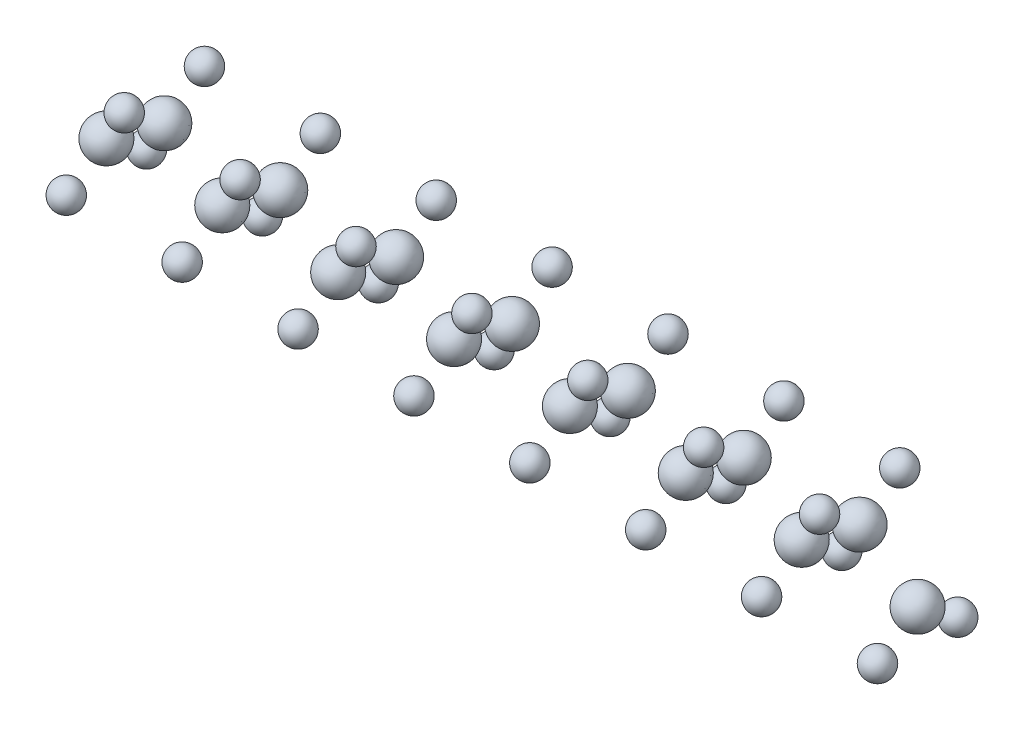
ISO-10303-21;
HEADER;
FILE_DESCRIPTION(('STEP AP214'),'2;1');
FILE_NAME('part.step','',(''),(''),'','','');
FILE_SCHEMA(('AUTOMOTIVE_DESIGN { 1 0 10303 214 1 1 1 1 }'));
ENDSEC;
DATA;
#1=APPLICATION_CONTEXT('core data for automotive mechanical design processes');
#2=APPLICATION_PROTOCOL_DEFINITION('international standard','automotive_design',2000,#1);
#3=PRODUCT_CONTEXT('',#1,'mechanical');
#4=PRODUCT('Part','Part','',(#3));
#5=PRODUCT_RELATED_PRODUCT_CATEGORY('part','',(#4));
#6=PRODUCT_DEFINITION_FORMATION('','',#4);
#7=PRODUCT_DEFINITION_CONTEXT('part definition',#1,'design');
#8=PRODUCT_DEFINITION('design','',#6,#7);
#9=PRODUCT_DEFINITION_SHAPE('','',#8);
#10=(LENGTH_UNIT() NAMED_UNIT(*) SI_UNIT(.MILLI.,.METRE.));
#11=(NAMED_UNIT(*) PLANE_ANGLE_UNIT() SI_UNIT($,.RADIAN.));
#12=(NAMED_UNIT(*) SI_UNIT($,.STERADIAN.) SOLID_ANGLE_UNIT());
#13=UNCERTAINTY_MEASURE_WITH_UNIT(LENGTH_MEASURE(1.E-05),#10,'distance_accuracy_value','');
#14=(GEOMETRIC_REPRESENTATION_CONTEXT(3) GLOBAL_UNCERTAINTY_ASSIGNED_CONTEXT((#13)) GLOBAL_UNIT_ASSIGNED_CONTEXT((#10,
#11,#12)) REPRESENTATION_CONTEXT('',''));
#15=CARTESIAN_POINT('',(0.,0.,0.));
#16=DIRECTION('',(0.,0.,1.));
#17=DIRECTION('',(1.,0.,0.));
#18=AXIS2_PLACEMENT_3D('',#15,#16,#17);
#19=CARTESIAN_POINT('',(16.406864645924,1.55175306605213,-0.873738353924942));
#20=DIRECTION('',(0.,1.,0.));
#21=DIRECTION('',(0.,0.,-1.));
#22=AXIS2_PLACEMENT_3D('',#19,#20,#21);
#23=SPHERICAL_SURFACE('',#22,0.3125);
#24=CARTESIAN_POINT('',(16.406864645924,1.86425306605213,-0.873738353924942));
#25=VERTEX_POINT('',#24);
#26=VERTEX_LOOP('',#25);
#27=FACE_BOUND('',#26,.T.);
#28=ADVANCED_FACE('F34',(#27),#23,.T.);
#29=CLOSED_SHELL('',(#28));
#30=MANIFOLD_SOLID_BREP('B2',#29);
#31=CARTESIAN_POINT('',(13.8827316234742,1.55175306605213,-0.873738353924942));
#32=DIRECTION('',(0.,1.,0.));
#33=DIRECTION('',(0.,0.,-1.));
#34=AXIS2_PLACEMENT_3D('',#31,#32,#33);
#35=SPHERICAL_SURFACE('',#34,0.3125);
#36=CARTESIAN_POINT('',(13.8827316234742,1.86425306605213,-0.873738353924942));
#37=VERTEX_POINT('',#36);
#38=VERTEX_LOOP('',#37);
#39=FACE_BOUND('',#38,.T.);
#40=ADVANCED_FACE('F53',(#39),#35,.T.);
#41=CLOSED_SHELL('',(#40));
#42=MANIFOLD_SOLID_BREP('B6',#41);
#43=CARTESIAN_POINT('',(11.3585986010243,1.55175306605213,-0.873738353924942));
#44=DIRECTION('',(0.,1.,0.));
#45=DIRECTION('',(0.,0.,-1.));
#46=AXIS2_PLACEMENT_3D('',#43,#44,#45);
#47=SPHERICAL_SURFACE('',#46,0.3125);
#48=CARTESIAN_POINT('',(11.3585986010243,1.86425306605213,-0.873738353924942));
#49=VERTEX_POINT('',#48);
#50=VERTEX_LOOP('',#49);
#51=FACE_BOUND('',#50,.T.);
#52=ADVANCED_FACE('F72',(#51),#47,.T.);
#53=CLOSED_SHELL('',(#52));
#54=MANIFOLD_SOLID_BREP('B30',#53);
#55=CARTESIAN_POINT('',(8.83446557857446,1.55175306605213,-0.873738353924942));
#56=DIRECTION('',(0.,1.,0.));
#57=DIRECTION('',(0.,0.,-1.));
#58=AXIS2_PLACEMENT_3D('',#55,#56,#57);
#59=SPHERICAL_SURFACE('',#58,0.3125);
#60=CARTESIAN_POINT('',(8.83446557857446,1.86425306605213,-0.873738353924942));
#61=VERTEX_POINT('',#60);
#62=VERTEX_LOOP('',#61);
#63=FACE_BOUND('',#62,.T.);
#64=ADVANCED_FACE('F91',(#63),#59,.T.);
#65=CLOSED_SHELL('',(#64));
#66=MANIFOLD_SOLID_BREP('B49',#65);
#67=CARTESIAN_POINT('',(6.31033255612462,1.55175306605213,-0.873738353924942));
#68=DIRECTION('',(0.,1.,0.));
#69=DIRECTION('',(0.,0.,-1.));
#70=AXIS2_PLACEMENT_3D('',#67,#68,#69);
#71=SPHERICAL_SURFACE('',#70,0.3125);
#72=CARTESIAN_POINT('',(6.31033255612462,1.86425306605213,-0.873738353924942));
#73=VERTEX_POINT('',#72);
#74=VERTEX_LOOP('',#73);
#75=FACE_BOUND('',#74,.T.);
#76=ADVANCED_FACE('F110',(#75),#71,.T.);
#77=CLOSED_SHELL('',(#76));
#78=MANIFOLD_SOLID_BREP('B68',#77);
#79=CARTESIAN_POINT('',(3.78619953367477,1.55175306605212,-0.873738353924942));
#80=DIRECTION('',(0.,1.,0.));
#81=DIRECTION('',(0.,0.,-1.));
#82=AXIS2_PLACEMENT_3D('',#79,#80,#81);
#83=SPHERICAL_SURFACE('',#82,0.3125);
#84=CARTESIAN_POINT('',(3.78619953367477,1.86425306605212,-0.873738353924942));
#85=VERTEX_POINT('',#84);
#86=VERTEX_LOOP('',#85);
#87=FACE_BOUND('',#86,.T.);
#88=ADVANCED_FACE('F129',(#87),#83,.T.);
#89=CLOSED_SHELL('',(#88));
#90=MANIFOLD_SOLID_BREP('B87',#89);
#91=CARTESIAN_POINT('',(16.406864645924,1.55175306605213,0.873738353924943));
#92=DIRECTION('',(0.,1.,0.));
#93=DIRECTION('',(0.,0.,-1.));
#94=AXIS2_PLACEMENT_3D('',#91,#92,#93);
#95=SPHERICAL_SURFACE('',#94,0.3125);
#96=CARTESIAN_POINT('',(16.406864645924,1.86425306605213,0.873738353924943));
#97=VERTEX_POINT('',#96);
#98=VERTEX_LOOP('',#97);
#99=FACE_BOUND('',#98,.T.);
#100=ADVANCED_FACE('F148',(#99),#95,.T.);
#101=CLOSED_SHELL('',(#100));
#102=MANIFOLD_SOLID_BREP('B106',#101);
#103=CARTESIAN_POINT('',(13.8827316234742,1.55175306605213,0.873738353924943));
#104=DIRECTION('',(0.,1.,0.));
#105=DIRECTION('',(0.,0.,-1.));
#106=AXIS2_PLACEMENT_3D('',#103,#104,#105);
#107=SPHERICAL_SURFACE('',#106,0.3125);
#108=CARTESIAN_POINT('',(13.8827316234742,1.86425306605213,0.873738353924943));
#109=VERTEX_POINT('',#108);
#110=VERTEX_LOOP('',#109);
#111=FACE_BOUND('',#110,.T.);
#112=ADVANCED_FACE('F167',(#111),#107,.T.);
#113=CLOSED_SHELL('',(#112));
#114=MANIFOLD_SOLID_BREP('B125',#113);
#115=CARTESIAN_POINT('',(11.3585986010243,1.55175306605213,0.873738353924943));
#116=DIRECTION('',(0.,1.,0.));
#117=DIRECTION('',(0.,0.,-1.));
#118=AXIS2_PLACEMENT_3D('',#115,#116,#117);
#119=SPHERICAL_SURFACE('',#118,0.3125);
#120=CARTESIAN_POINT('',(11.3585986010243,1.86425306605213,0.873738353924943));
#121=VERTEX_POINT('',#120);
#122=VERTEX_LOOP('',#121);
#123=FACE_BOUND('',#122,.T.);
#124=ADVANCED_FACE('F186',(#123),#119,.T.);
#125=CLOSED_SHELL('',(#124));
#126=MANIFOLD_SOLID_BREP('B144',#125);
#127=CARTESIAN_POINT('',(8.83446557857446,1.55175306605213,0.873738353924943));
#128=DIRECTION('',(0.,1.,0.));
#129=DIRECTION('',(0.,0.,-1.));
#130=AXIS2_PLACEMENT_3D('',#127,#128,#129);
#131=SPHERICAL_SURFACE('',#130,0.3125);
#132=CARTESIAN_POINT('',(8.83446557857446,1.86425306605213,0.873738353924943));
#133=VERTEX_POINT('',#132);
#134=VERTEX_LOOP('',#133);
#135=FACE_BOUND('',#134,.T.);
#136=ADVANCED_FACE('F205',(#135),#131,.T.);
#137=CLOSED_SHELL('',(#136));
#138=MANIFOLD_SOLID_BREP('B163',#137);
#139=CARTESIAN_POINT('',(6.31033255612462,1.55175306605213,0.873738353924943));
#140=DIRECTION('',(0.,1.,0.));
#141=DIRECTION('',(0.,0.,-1.));
#142=AXIS2_PLACEMENT_3D('',#139,#140,#141);
#143=SPHERICAL_SURFACE('',#142,0.3125);
#144=CARTESIAN_POINT('',(6.31033255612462,1.86425306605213,0.873738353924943));
#145=VERTEX_POINT('',#144);
#146=VERTEX_LOOP('',#145);
#147=FACE_BOUND('',#146,.T.);
#148=ADVANCED_FACE('F224',(#147),#143,.T.);
#149=CLOSED_SHELL('',(#148));
#150=MANIFOLD_SOLID_BREP('B182',#149);
#151=CARTESIAN_POINT('',(3.78619953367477,1.55175306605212,0.873738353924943));
#152=DIRECTION('',(0.,1.,0.));
#153=DIRECTION('',(0.,0.,-1.));
#154=AXIS2_PLACEMENT_3D('',#151,#152,#153);
#155=SPHERICAL_SURFACE('',#154,0.3125);
#156=CARTESIAN_POINT('',(3.78619953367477,1.86425306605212,0.873738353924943));
#157=VERTEX_POINT('',#156);
#158=VERTEX_LOOP('',#157);
#159=FACE_BOUND('',#158,.T.);
#160=ADVANCED_FACE('F243',(#159),#155,.T.);
#161=CLOSED_SHELL('',(#160));
#162=MANIFOLD_SOLID_BREP('B201',#161);
#163=CARTESIAN_POINT('',(17.6689311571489,-0.634808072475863,-0.873738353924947));
#164=DIRECTION('',(0.,1.,0.));
#165=DIRECTION('',(0.,0.,-1.));
#166=AXIS2_PLACEMENT_3D('',#163,#164,#165);
#167=SPHERICAL_SURFACE('',#166,0.3125);
#168=CARTESIAN_POINT('',(17.6689311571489,-0.322308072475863,-0.873738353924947));
#169=VERTEX_POINT('',#168);
#170=VERTEX_LOOP('',#169);
#171=FACE_BOUND('',#170,.T.);
#172=ADVANCED_FACE('F262',(#171),#167,.T.);
#173=CLOSED_SHELL('',(#172));
#174=MANIFOLD_SOLID_BREP('B220',#173);
#175=CARTESIAN_POINT('',(15.1447981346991,-0.634808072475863,-0.873738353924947));
#176=DIRECTION('',(0.,1.,0.));
#177=DIRECTION('',(0.,0.,-1.));
#178=AXIS2_PLACEMENT_3D('',#175,#176,#177);
#179=SPHERICAL_SURFACE('',#178,0.3125);
#180=CARTESIAN_POINT('',(15.1447981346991,-0.322308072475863,-0.873738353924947));
#181=VERTEX_POINT('',#180);
#182=VERTEX_LOOP('',#181);
#183=FACE_BOUND('',#182,.T.);
#184=ADVANCED_FACE('F281',(#183),#179,.T.);
#185=CLOSED_SHELL('',(#184));
#186=MANIFOLD_SOLID_BREP('B239',#185);
#187=CARTESIAN_POINT('',(12.6206651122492,-0.634808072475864,-0.873738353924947));
#188=DIRECTION('',(0.,1.,0.));
#189=DIRECTION('',(0.,0.,-1.));
#190=AXIS2_PLACEMENT_3D('',#187,#188,#189);
#191=SPHERICAL_SURFACE('',#190,0.3125);
#192=CARTESIAN_POINT('',(12.6206651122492,-0.322308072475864,-0.873738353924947));
#193=VERTEX_POINT('',#192);
#194=VERTEX_LOOP('',#193);
#195=FACE_BOUND('',#194,.T.);
#196=ADVANCED_FACE('F300',(#195),#191,.T.);
#197=CLOSED_SHELL('',(#196));
#198=MANIFOLD_SOLID_BREP('B258',#197);
#199=CARTESIAN_POINT('',(10.0965320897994,-0.634808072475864,-0.873738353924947));
#200=DIRECTION('',(0.,1.,0.));
#201=DIRECTION('',(0.,0.,-1.));
#202=AXIS2_PLACEMENT_3D('',#199,#200,#201);
#203=SPHERICAL_SURFACE('',#202,0.3125);
#204=CARTESIAN_POINT('',(10.0965320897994,-0.322308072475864,-0.873738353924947));
#205=VERTEX_POINT('',#204);
#206=VERTEX_LOOP('',#205);
#207=FACE_BOUND('',#206,.T.);
#208=ADVANCED_FACE('F319',(#207),#203,.T.);
#209=CLOSED_SHELL('',(#208));
#210=MANIFOLD_SOLID_BREP('B277',#209);
#211=CARTESIAN_POINT('',(7.57239906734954,-0.634808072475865,-0.873738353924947));
#212=DIRECTION('',(0.,1.,0.));
#213=DIRECTION('',(0.,0.,-1.));
#214=AXIS2_PLACEMENT_3D('',#211,#212,#213);
#215=SPHERICAL_SURFACE('',#214,0.3125);
#216=CARTESIAN_POINT('',(7.57239906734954,-0.322308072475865,-0.873738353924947));
#217=VERTEX_POINT('',#216);
#218=VERTEX_LOOP('',#217);
#219=FACE_BOUND('',#218,.T.);
#220=ADVANCED_FACE('F338',(#219),#215,.T.);
#221=CLOSED_SHELL('',(#220));
#222=MANIFOLD_SOLID_BREP('B296',#221);
#223=CARTESIAN_POINT('',(5.04826604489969,-0.634808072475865,-0.873738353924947));
#224=DIRECTION('',(0.,1.,0.));
#225=DIRECTION('',(0.,0.,-1.));
#226=AXIS2_PLACEMENT_3D('',#223,#224,#225);
#227=SPHERICAL_SURFACE('',#226,0.3125);
#228=CARTESIAN_POINT('',(5.04826604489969,-0.322308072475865,-0.873738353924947));
#229=VERTEX_POINT('',#228);
#230=VERTEX_LOOP('',#229);
#231=FACE_BOUND('',#230,.T.);
#232=ADVANCED_FACE('F357',(#231),#227,.T.);
#233=CLOSED_SHELL('',(#232));
#234=MANIFOLD_SOLID_BREP('B315',#233);
#235=CARTESIAN_POINT('',(2.52413302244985,-0.634808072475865,-0.873738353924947));
#236=DIRECTION('',(0.,1.,0.));
#237=DIRECTION('',(0.,0.,-1.));
#238=AXIS2_PLACEMENT_3D('',#235,#236,#237);
#239=SPHERICAL_SURFACE('',#238,0.3125);
#240=CARTESIAN_POINT('',(2.52413302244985,-0.322308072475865,-0.873738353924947));
#241=VERTEX_POINT('',#240);
#242=VERTEX_LOOP('',#241);
#243=FACE_BOUND('',#242,.T.);
#244=ADVANCED_FACE('F376',(#243),#239,.T.);
#245=CLOSED_SHELL('',(#244));
#246=MANIFOLD_SOLID_BREP('B334',#245);
#247=CARTESIAN_POINT('',(17.6689311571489,-0.63480807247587,0.873738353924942));
#248=DIRECTION('',(0.,1.,0.));
#249=DIRECTION('',(0.,0.,-1.));
#250=AXIS2_PLACEMENT_3D('',#247,#248,#249);
#251=SPHERICAL_SURFACE('',#250,0.3125);
#252=CARTESIAN_POINT('',(17.6689311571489,-0.32230807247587,0.873738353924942));
#253=VERTEX_POINT('',#252);
#254=VERTEX_LOOP('',#253);
#255=FACE_BOUND('',#254,.T.);
#256=ADVANCED_FACE('F395',(#255),#251,.T.);
#257=CLOSED_SHELL('',(#256));
#258=MANIFOLD_SOLID_BREP('B353',#257);
#259=CARTESIAN_POINT('',(15.1447981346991,-0.63480807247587,0.873738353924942));
#260=DIRECTION('',(0.,1.,0.));
#261=DIRECTION('',(0.,0.,-1.));
#262=AXIS2_PLACEMENT_3D('',#259,#260,#261);
#263=SPHERICAL_SURFACE('',#262,0.3125);
#264=CARTESIAN_POINT('',(15.1447981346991,-0.32230807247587,0.873738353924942));
#265=VERTEX_POINT('',#264);
#266=VERTEX_LOOP('',#265);
#267=FACE_BOUND('',#266,.T.);
#268=ADVANCED_FACE('F414',(#267),#263,.T.);
#269=CLOSED_SHELL('',(#268));
#270=MANIFOLD_SOLID_BREP('B372',#269);
#271=CARTESIAN_POINT('',(12.6206651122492,-0.634808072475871,0.873738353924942));
#272=DIRECTION('',(0.,1.,0.));
#273=DIRECTION('',(0.,0.,-1.));
#274=AXIS2_PLACEMENT_3D('',#271,#272,#273);
#275=SPHERICAL_SURFACE('',#274,0.3125);
#276=CARTESIAN_POINT('',(12.6206651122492,-0.322308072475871,0.873738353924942));
#277=VERTEX_POINT('',#276);
#278=VERTEX_LOOP('',#277);
#279=FACE_BOUND('',#278,.T.);
#280=ADVANCED_FACE('F433',(#279),#275,.T.);
#281=CLOSED_SHELL('',(#280));
#282=MANIFOLD_SOLID_BREP('B391',#281);
#283=CARTESIAN_POINT('',(10.0965320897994,-0.634808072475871,0.873738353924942));
#284=DIRECTION('',(0.,1.,0.));
#285=DIRECTION('',(0.,0.,-1.));
#286=AXIS2_PLACEMENT_3D('',#283,#284,#285);
#287=SPHERICAL_SURFACE('',#286,0.3125);
#288=CARTESIAN_POINT('',(10.0965320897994,-0.322308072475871,0.873738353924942));
#289=VERTEX_POINT('',#288);
#290=VERTEX_LOOP('',#289);
#291=FACE_BOUND('',#290,.T.);
#292=ADVANCED_FACE('F452',(#291),#287,.T.);
#293=CLOSED_SHELL('',(#292));
#294=MANIFOLD_SOLID_BREP('B410',#293);
#295=CARTESIAN_POINT('',(7.57239906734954,-0.634808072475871,0.873738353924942));
#296=DIRECTION('',(0.,1.,0.));
#297=DIRECTION('',(0.,0.,-1.));
#298=AXIS2_PLACEMENT_3D('',#295,#296,#297);
#299=SPHERICAL_SURFACE('',#298,0.3125);
#300=CARTESIAN_POINT('',(7.57239906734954,-0.322308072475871,0.873738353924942));
#301=VERTEX_POINT('',#300);
#302=VERTEX_LOOP('',#301);
#303=FACE_BOUND('',#302,.T.);
#304=ADVANCED_FACE('F471',(#303),#299,.T.);
#305=CLOSED_SHELL('',(#304));
#306=MANIFOLD_SOLID_BREP('B429',#305);
#307=CARTESIAN_POINT('',(5.04826604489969,-0.634808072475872,0.873738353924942));
#308=DIRECTION('',(0.,1.,0.));
#309=DIRECTION('',(0.,0.,-1.));
#310=AXIS2_PLACEMENT_3D('',#307,#308,#309);
#311=SPHERICAL_SURFACE('',#310,0.3125);
#312=CARTESIAN_POINT('',(5.04826604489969,-0.322308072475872,0.873738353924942));
#313=VERTEX_POINT('',#312);
#314=VERTEX_LOOP('',#313);
#315=FACE_BOUND('',#314,.T.);
#316=ADVANCED_FACE('F490',(#315),#311,.T.);
#317=CLOSED_SHELL('',(#316));
#318=MANIFOLD_SOLID_BREP('B448',#317);
#319=CARTESIAN_POINT('',(2.52413302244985,-0.634808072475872,0.873738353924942));
#320=DIRECTION('',(0.,1.,0.));
#321=DIRECTION('',(0.,0.,-1.));
#322=AXIS2_PLACEMENT_3D('',#319,#320,#321);
#323=SPHERICAL_SURFACE('',#322,0.3125);
#324=CARTESIAN_POINT('',(2.52413302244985,-0.322308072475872,0.873738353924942));
#325=VERTEX_POINT('',#324);
#326=VERTEX_LOOP('',#325);
#327=FACE_BOUND('',#326,.T.);
#328=ADVANCED_FACE('F509',(#327),#323,.T.);
#329=CLOSED_SHELL('',(#328));
#330=MANIFOLD_SOLID_BREP('B467',#329);
#331=CARTESIAN_POINT('',(17.6681330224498,0.,0.));
#332=DIRECTION('',(0.,1.,0.));
#333=DIRECTION('',(1.,0.,0.));
#334=AXIS2_PLACEMENT_3D('',#331,#332,#333);
#335=SPHERICAL_SURFACE('',#334,0.425);
#336=CARTESIAN_POINT('',(17.6681330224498,0.425000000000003,0.));
#337=VERTEX_POINT('',#336);
#338=VERTEX_LOOP('',#337);
#339=FACE_BOUND('',#338,.T.);
#340=ADVANCED_FACE('F528',(#339),#335,.T.);
#341=CLOSED_SHELL('',(#340));
#342=MANIFOLD_SOLID_BREP('B486',#341);
#343=CARTESIAN_POINT('',(1.26206651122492,1.55175306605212,-0.873738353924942));
#344=DIRECTION('',(0.,1.,0.));
#345=DIRECTION('',(0.,0.,-1.));
#346=AXIS2_PLACEMENT_3D('',#343,#344,#345);
#347=SPHERICAL_SURFACE('',#346,0.3125);
#348=CARTESIAN_POINT('',(1.26206651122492,1.86425306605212,-0.873738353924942));
#349=VERTEX_POINT('',#348);
#350=VERTEX_LOOP('',#349);
#351=FACE_BOUND('',#350,.T.);
#352=ADVANCED_FACE('F547',(#351),#347,.T.);
#353=CLOSED_SHELL('',(#352));
#354=MANIFOLD_SOLID_BREP('B505',#353);
#355=CARTESIAN_POINT('',(1.26206651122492,1.55175306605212,0.873738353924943));
#356=DIRECTION('',(0.,1.,0.));
#357=DIRECTION('',(0.,0.,-1.));
#358=AXIS2_PLACEMENT_3D('',#355,#356,#357);
#359=SPHERICAL_SURFACE('',#358,0.3125);
#360=CARTESIAN_POINT('',(1.26206651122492,1.86425306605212,0.873738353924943));
#361=VERTEX_POINT('',#360);
#362=VERTEX_LOOP('',#361);
#363=FACE_BOUND('',#362,.T.);
#364=ADVANCED_FACE('F566',(#363),#359,.T.);
#365=CLOSED_SHELL('',(#364));
#366=MANIFOLD_SOLID_BREP('B524',#365);
#367=CARTESIAN_POINT('',(0.,-0.634808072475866,-0.873738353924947));
#368=DIRECTION('',(0.,1.,0.));
#369=DIRECTION('',(0.,0.,-1.));
#370=AXIS2_PLACEMENT_3D('',#367,#368,#369);
#371=SPHERICAL_SURFACE('',#370,0.3125);
#372=CARTESIAN_POINT('',(0.,-0.322308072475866,-0.873738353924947));
#373=VERTEX_POINT('',#372);
#374=VERTEX_LOOP('',#373);
#375=FACE_BOUND('',#374,.T.);
#376=ADVANCED_FACE('F585',(#375),#371,.T.);
#377=CLOSED_SHELL('',(#376));
#378=MANIFOLD_SOLID_BREP('B543',#377);
#379=CARTESIAN_POINT('',(0.,-0.634808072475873,0.873738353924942));
#380=DIRECTION('',(0.,1.,0.));
#381=DIRECTION('',(0.,0.,-1.));
#382=AXIS2_PLACEMENT_3D('',#379,#380,#381);
#383=SPHERICAL_SURFACE('',#382,0.3125);
#384=CARTESIAN_POINT('',(0.,-0.322308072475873,0.873738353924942));
#385=VERTEX_POINT('',#384);
#386=VERTEX_LOOP('',#385);
#387=FACE_BOUND('',#386,.T.);
#388=ADVANCED_FACE('F604',(#387),#383,.T.);
#389=CLOSED_SHELL('',(#388));
#390=MANIFOLD_SOLID_BREP('B562',#389);
#391=CARTESIAN_POINT('',(15.144,0.,0.));
#392=DIRECTION('',(0.,1.,0.));
#393=DIRECTION('',(1.,0.,0.));
#394=AXIS2_PLACEMENT_3D('',#391,#392,#393);
#395=SPHERICAL_SURFACE('',#394,0.425);
#396=CARTESIAN_POINT('',(15.144,0.425000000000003,0.));
#397=VERTEX_POINT('',#396);
#398=VERTEX_LOOP('',#397);
#399=FACE_BOUND('',#398,.T.);
#400=ADVANCED_FACE('F623',(#399),#395,.T.);
#401=CLOSED_SHELL('',(#400));
#402=MANIFOLD_SOLID_BREP('B581',#401);
#403=CARTESIAN_POINT('',(12.62,0.,0.));
#404=DIRECTION('',(0.,1.,0.));
#405=DIRECTION('',(1.,0.,0.));
#406=AXIS2_PLACEMENT_3D('',#403,#404,#405);
#407=SPHERICAL_SURFACE('',#406,0.425);
#408=CARTESIAN_POINT('',(12.62,0.425000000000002,0.));
#409=VERTEX_POINT('',#408);
#410=VERTEX_LOOP('',#409);
#411=FACE_BOUND('',#410,.T.);
#412=ADVANCED_FACE('F642',(#411),#407,.T.);
#413=CLOSED_SHELL('',(#412));
#414=MANIFOLD_SOLID_BREP('B600',#413);
#415=CARTESIAN_POINT('',(10.096,0.,0.));
#416=DIRECTION('',(0.,1.,0.));
#417=DIRECTION('',(1.,0.,0.));
#418=AXIS2_PLACEMENT_3D('',#415,#416,#417);
#419=SPHERICAL_SURFACE('',#418,0.425);
#420=CARTESIAN_POINT('',(10.096,0.425000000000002,0.));
#421=VERTEX_POINT('',#420);
#422=VERTEX_LOOP('',#421);
#423=FACE_BOUND('',#422,.T.);
#424=ADVANCED_FACE('F661',(#423),#419,.T.);
#425=CLOSED_SHELL('',(#424));
#426=MANIFOLD_SOLID_BREP('B619',#425);
#427=CARTESIAN_POINT('',(7.572,0.,0.));
#428=DIRECTION('',(0.,1.,0.));
#429=DIRECTION('',(1.,0.,0.));
#430=AXIS2_PLACEMENT_3D('',#427,#428,#429);
#431=SPHERICAL_SURFACE('',#430,0.425);
#432=CARTESIAN_POINT('',(7.572,0.425000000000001,0.));
#433=VERTEX_POINT('',#432);
#434=VERTEX_LOOP('',#433);
#435=FACE_BOUND('',#434,.T.);
#436=ADVANCED_FACE('F680',(#435),#431,.T.);
#437=CLOSED_SHELL('',(#436));
#438=MANIFOLD_SOLID_BREP('B638',#437);
#439=CARTESIAN_POINT('',(5.048,0.,0.));
#440=DIRECTION('',(0.,1.,0.));
#441=DIRECTION('',(1.,0.,0.));
#442=AXIS2_PLACEMENT_3D('',#439,#440,#441);
#443=SPHERICAL_SURFACE('',#442,0.425);
#444=CARTESIAN_POINT('',(5.048,0.425000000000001,0.));
#445=VERTEX_POINT('',#444);
#446=VERTEX_LOOP('',#445);
#447=FACE_BOUND('',#446,.T.);
#448=ADVANCED_FACE('F699',(#447),#443,.T.);
#449=CLOSED_SHELL('',(#448));
#450=MANIFOLD_SOLID_BREP('B657',#449);
#451=CARTESIAN_POINT('',(2.524,0.,0.));
#452=DIRECTION('',(0.,1.,0.));
#453=DIRECTION('',(1.,0.,0.));
#454=AXIS2_PLACEMENT_3D('',#451,#452,#453);
#455=SPHERICAL_SURFACE('',#454,0.425);
#456=CARTESIAN_POINT('',(2.524,0.425,0.));
#457=VERTEX_POINT('',#456);
#458=VERTEX_LOOP('',#457);
#459=FACE_BOUND('',#458,.T.);
#460=ADVANCED_FACE('F718',(#459),#455,.T.);
#461=CLOSED_SHELL('',(#460));
#462=MANIFOLD_SOLID_BREP('B676',#461);
#463=CARTESIAN_POINT('',(16.4060665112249,0.916944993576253,0.));
#464=DIRECTION('',(0.,1.,0.));
#465=DIRECTION('',(1.,0.,0.));
#466=AXIS2_PLACEMENT_3D('',#463,#464,#465);
#467=SPHERICAL_SURFACE('',#466,0.425);
#468=CARTESIAN_POINT('',(16.4060665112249,1.34194499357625,0.));
#469=VERTEX_POINT('',#468);
#470=VERTEX_LOOP('',#469);
#471=FACE_BOUND('',#470,.T.);
#472=ADVANCED_FACE('F737',(#471),#467,.T.);
#473=CLOSED_SHELL('',(#472));
#474=MANIFOLD_SOLID_BREP('B695',#473);
#475=CARTESIAN_POINT('',(13.8820665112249,0.916944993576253,0.));
#476=DIRECTION('',(0.,1.,0.));
#477=DIRECTION('',(1.,0.,0.));
#478=AXIS2_PLACEMENT_3D('',#475,#476,#477);
#479=SPHERICAL_SURFACE('',#478,0.425);
#480=CARTESIAN_POINT('',(13.8820665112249,1.34194499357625,0.));
#481=VERTEX_POINT('',#480);
#482=VERTEX_LOOP('',#481);
#483=FACE_BOUND('',#482,.T.);
#484=ADVANCED_FACE('F756',(#483),#479,.T.);
#485=CLOSED_SHELL('',(#484));
#486=MANIFOLD_SOLID_BREP('B714',#485);
#487=CARTESIAN_POINT('',(11.3580665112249,0.916944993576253,0.));
#488=DIRECTION('',(0.,1.,0.));
#489=DIRECTION('',(1.,0.,0.));
#490=AXIS2_PLACEMENT_3D('',#487,#488,#489);
#491=SPHERICAL_SURFACE('',#490,0.425);
#492=CARTESIAN_POINT('',(11.3580665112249,1.34194499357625,0.));
#493=VERTEX_POINT('',#492);
#494=VERTEX_LOOP('',#493);
#495=FACE_BOUND('',#494,.T.);
#496=ADVANCED_FACE('F775',(#495),#491,.T.);
#497=CLOSED_SHELL('',(#496));
#498=MANIFOLD_SOLID_BREP('B733',#497);
#499=CARTESIAN_POINT('',(8.83406651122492,0.916944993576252,0.));
#500=DIRECTION('',(0.,1.,0.));
#501=DIRECTION('',(1.,0.,0.));
#502=AXIS2_PLACEMENT_3D('',#499,#500,#501);
#503=SPHERICAL_SURFACE('',#502,0.425);
#504=CARTESIAN_POINT('',(8.83406651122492,1.34194499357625,0.));
#505=VERTEX_POINT('',#504);
#506=VERTEX_LOOP('',#505);
#507=FACE_BOUND('',#506,.T.);
#508=ADVANCED_FACE('F794',(#507),#503,.T.);
#509=CLOSED_SHELL('',(#508));
#510=MANIFOLD_SOLID_BREP('B752',#509);
#511=CARTESIAN_POINT('',(6.31006651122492,0.916944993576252,0.));
#512=DIRECTION('',(0.,1.,0.));
#513=DIRECTION('',(1.,0.,0.));
#514=AXIS2_PLACEMENT_3D('',#511,#512,#513);
#515=SPHERICAL_SURFACE('',#514,0.425);
#516=CARTESIAN_POINT('',(6.31006651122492,1.34194499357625,0.));
#517=VERTEX_POINT('',#516);
#518=VERTEX_LOOP('',#517);
#519=FACE_BOUND('',#518,.T.);
#520=ADVANCED_FACE('F813',(#519),#515,.T.);
#521=CLOSED_SHELL('',(#520));
#522=MANIFOLD_SOLID_BREP('B771',#521);
#523=CARTESIAN_POINT('',(3.78606651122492,0.916944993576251,0.));
#524=DIRECTION('',(0.,1.,0.));
#525=DIRECTION('',(1.,0.,0.));
#526=AXIS2_PLACEMENT_3D('',#523,#524,#525);
#527=SPHERICAL_SURFACE('',#526,0.425);
#528=CARTESIAN_POINT('',(3.78606651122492,1.34194499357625,0.));
#529=VERTEX_POINT('',#528);
#530=VERTEX_LOOP('',#529);
#531=FACE_BOUND('',#530,.T.);
#532=ADVANCED_FACE('F832',(#531),#527,.T.);
#533=CLOSED_SHELL('',(#532));
#534=MANIFOLD_SOLID_BREP('B790',#533);
#535=CARTESIAN_POINT('',(1.26206651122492,0.916944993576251,0.));
#536=DIRECTION('',(0.,1.,0.));
#537=DIRECTION('',(1.,0.,0.));
#538=AXIS2_PLACEMENT_3D('',#535,#536,#537);
#539=SPHERICAL_SURFACE('',#538,0.425);
#540=CARTESIAN_POINT('',(1.26206651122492,1.34194499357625,0.));
#541=VERTEX_POINT('',#540);
#542=VERTEX_LOOP('',#541);
#543=FACE_BOUND('',#542,.T.);
#544=ADVANCED_FACE('F850',(#543),#539,.T.);
#545=CLOSED_SHELL('',(#544));
#546=MANIFOLD_SOLID_BREP('B809',#545);
#547=CARTESIAN_POINT('',(0.,0.,0.));
#548=DIRECTION('',(0.,1.,0.));
#549=DIRECTION('',(1.,0.,0.));
#550=AXIS2_PLACEMENT_3D('',#547,#548,#549);
#551=SPHERICAL_SURFACE('',#550,0.425);
#552=CARTESIAN_POINT('',(0.,0.425,0.));
#553=VERTEX_POINT('',#552);
#554=VERTEX_LOOP('',#553);
#555=FACE_BOUND('',#554,.T.);
#556=ADVANCED_FACE('F863',(#555),#551,.T.);
#557=CLOSED_SHELL('',(#556));
#558=MANIFOLD_SOLID_BREP('B828',#557);
#559=ADVANCED_BREP_SHAPE_REPRESENTATION('',(#18,#30,#42,#54,#66,#78,#90,#102,#114,#126,#138,
#150,#162,#174,#186,#198,#210,#222,#234,#246,#258,#270,#282,#294,#306,#318,#330,#342,#354,#366,
#378,#390,#402,#414,#426,#438,#450,#462,#474,#486,#498,#510,#522,#534,#546,#558),#14);
#560=SHAPE_DEFINITION_REPRESENTATION(#9,#559);
ENDSEC;
END-ISO-10303-21;
